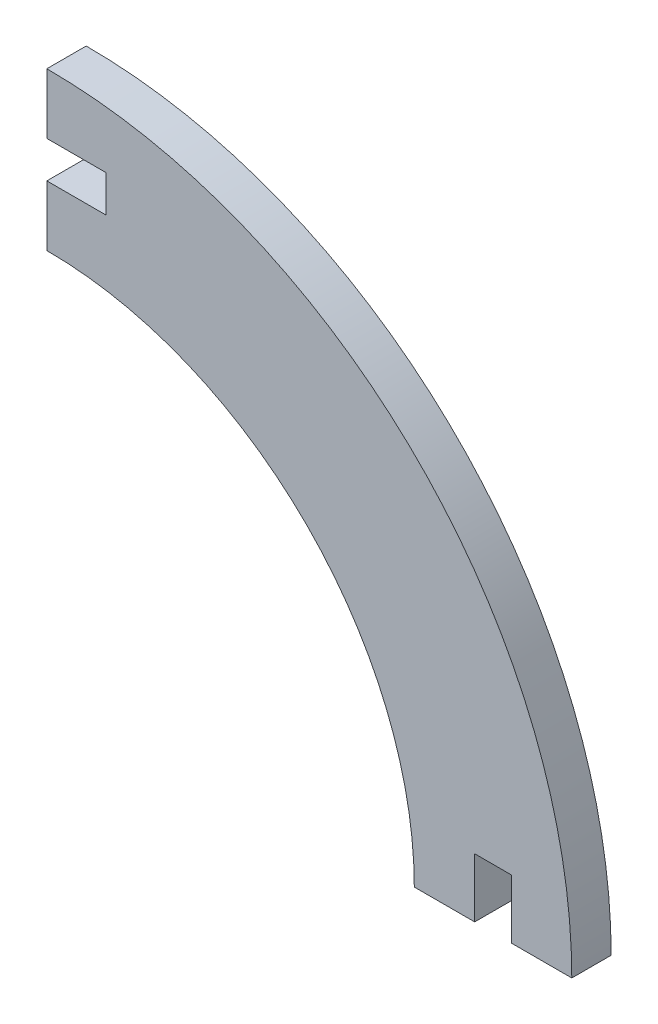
ISO-10303-21;
HEADER;
FILE_DESCRIPTION(('STEP AP214'),'2;1');
FILE_NAME('part.step','',(''),(''),'','','');
FILE_SCHEMA(('AUTOMOTIVE_DESIGN { 1 0 10303 214 1 1 1 1 }'));
ENDSEC;
DATA;
#1=APPLICATION_CONTEXT('core data for automotive mechanical design processes');
#2=APPLICATION_PROTOCOL_DEFINITION('international standard','automotive_design',2000,#1);
#3=PRODUCT_CONTEXT('',#1,'mechanical');
#4=PRODUCT('Part','Part','',(#3));
#5=PRODUCT_RELATED_PRODUCT_CATEGORY('part','',(#4));
#6=PRODUCT_DEFINITION_FORMATION('','',#4);
#7=PRODUCT_DEFINITION_CONTEXT('part definition',#1,'design');
#8=PRODUCT_DEFINITION('design','',#6,#7);
#9=PRODUCT_DEFINITION_SHAPE('','',#8);
#10=(LENGTH_UNIT() NAMED_UNIT(*) SI_UNIT(.MILLI.,.METRE.));
#11=(NAMED_UNIT(*) PLANE_ANGLE_UNIT() SI_UNIT($,.RADIAN.));
#12=(NAMED_UNIT(*) SI_UNIT($,.STERADIAN.) SOLID_ANGLE_UNIT());
#13=UNCERTAINTY_MEASURE_WITH_UNIT(LENGTH_MEASURE(1.E-05),#10,'distance_accuracy_value','');
#14=(GEOMETRIC_REPRESENTATION_CONTEXT(3) GLOBAL_UNCERTAINTY_ASSIGNED_CONTEXT((#13)) GLOBAL_UNIT_ASSIGNED_CONTEXT((#10,
#11,#12)) REPRESENTATION_CONTEXT('',''));
#15=CARTESIAN_POINT('',(0.,0.,0.));
#16=DIRECTION('',(0.,0.,1.));
#17=DIRECTION('',(1.,0.,0.));
#18=AXIS2_PLACEMENT_3D('',#15,#16,#17);
#19=CARTESIAN_POINT('',(0.,-3.32449345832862E-10,3.));
#20=DIRECTION('',(0.,0.,-1.));
#21=DIRECTION('',(-1.,0.,0.));
#22=AXIS2_PLACEMENT_3D('',#19,#20,#21);
#23=CYLINDRICAL_SURFACE('',#22,40.0000000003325);
#24=CARTESIAN_POINT('',(0.,-3.32449345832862E-10,0.));
#25=DIRECTION('',(0.,0.,1.));
#26=DIRECTION('',(-1.,0.,0.));
#27=AXIS2_PLACEMENT_3D('',#24,#25,#26);
#28=CIRCLE('',#27,40.0000000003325);
#29=CARTESIAN_POINT('',(40.0000000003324,-3.32446896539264E-10,0.));
#30=VERTEX_POINT('',#29);
#31=CARTESIAN_POINT('',(0.,40.,0.));
#32=VERTEX_POINT('',#31);
#33=EDGE_CURVE('E153',#30,#32,#28,.T.);
#34=ORIENTED_EDGE('',*,*,#33,.T.);
#35=DIRECTION('',(0.,0.,-1.));
#36=VECTOR('',#35,1.);
#37=CARTESIAN_POINT('',(0.,40.,3.));
#38=LINE('',#37,#36);
#39=CARTESIAN_POINT('',(0.,40.,3.));
#40=VERTEX_POINT('',#39);
#41=EDGE_CURVE('E11',#40,#32,#38,.T.);
#42=ORIENTED_EDGE('',*,*,#41,.F.);
#43=CARTESIAN_POINT('',(0.,-3.32449345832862E-10,3.));
#44=DIRECTION('',(0.,0.,1.));
#45=DIRECTION('',(-1.,0.,0.));
#46=AXIS2_PLACEMENT_3D('',#43,#44,#45);
#47=CIRCLE('',#46,40.0000000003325);
#48=CARTESIAN_POINT('',(40.0000000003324,-3.32446896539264E-10,3.));
#49=VERTEX_POINT('',#48);
#50=EDGE_CURVE('E175',#49,#40,#47,.T.);
#51=ORIENTED_EDGE('',*,*,#50,.F.);
#52=DIRECTION('',(0.,0.,-1.));
#53=VECTOR('',#52,1.);
#54=CARTESIAN_POINT('',(40.0000000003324,-3.32446896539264E-10,3.));
#55=LINE('',#54,#53);
#56=EDGE_CURVE('E149',#49,#30,#55,.T.);
#57=ORIENTED_EDGE('',*,*,#56,.T.);
#58=EDGE_LOOP('',(#34,#42,#51,#57));
#59=FACE_BOUND('',#58,.T.);
#60=ADVANCED_FACE('F33',(#59),#23,.T.);
#61=CARTESIAN_POINT('',(0.,35.4,3.));
#62=DIRECTION('',(1.,0.,0.));
#63=DIRECTION('',(0.,1.,0.));
#64=AXIS2_PLACEMENT_3D('',#61,#62,#63);
#65=PLANE('',#64);
#66=DIRECTION('',(0.,-1.,0.));
#67=VECTOR('',#66,1.);
#68=CARTESIAN_POINT('',(0.,35.4,0.));
#69=LINE('',#68,#67);
#70=CARTESIAN_POINT('',(0.,35.4,0.));
#71=VERTEX_POINT('',#70);
#72=EDGE_CURVE('E156',#32,#71,#69,.T.);
#73=ORIENTED_EDGE('',*,*,#72,.T.);
#74=DIRECTION('',(0.,0.,-1.));
#75=VECTOR('',#74,1.);
#76=CARTESIAN_POINT('',(0.,35.4,3.));
#77=LINE('',#76,#75);
#78=CARTESIAN_POINT('',(0.,35.4,3.));
#79=VERTEX_POINT('',#78);
#80=EDGE_CURVE('E41',#79,#71,#77,.T.);
#81=ORIENTED_EDGE('',*,*,#80,.F.);
#82=DIRECTION('',(0.,-1.,0.));
#83=VECTOR('',#82,1.);
#84=CARTESIAN_POINT('',(0.,35.4,3.));
#85=LINE('',#84,#83);
#86=EDGE_CURVE('E104',#40,#79,#85,.T.);
#87=ORIENTED_EDGE('',*,*,#86,.F.);
#88=ORIENTED_EDGE('',*,*,#41,.T.);
#89=EDGE_LOOP('',(#73,#81,#87,#88));
#90=FACE_BOUND('',#89,.T.);
#91=ADVANCED_FACE('F253',(#90),#65,.F.);
#92=CARTESIAN_POINT('',(0.,35.4,3.));
#93=DIRECTION('',(0.,1.,0.));
#94=DIRECTION('',(0.,0.,1.));
#95=AXIS2_PLACEMENT_3D('',#92,#93,#94);
#96=PLANE('',#95);
#97=DIRECTION('',(1.,0.,0.));
#98=VECTOR('',#97,1.);
#99=CARTESIAN_POINT('',(0.,35.4,0.));
#100=LINE('',#99,#98);
#101=CARTESIAN_POINT('',(4.5,35.4,0.));
#102=VERTEX_POINT('',#101);
#103=EDGE_CURVE('E158',#71,#102,#100,.T.);
#104=ORIENTED_EDGE('',*,*,#103,.T.);
#105=DIRECTION('',(0.,0.,-1.));
#106=VECTOR('',#105,1.);
#107=CARTESIAN_POINT('',(4.5,35.4,3.));
#108=LINE('',#107,#106);
#109=CARTESIAN_POINT('',(4.5,35.4,3.));
#110=VERTEX_POINT('',#109);
#111=EDGE_CURVE('E194',#110,#102,#108,.T.);
#112=ORIENTED_EDGE('',*,*,#111,.F.);
#113=DIRECTION('',(1.,0.,0.));
#114=VECTOR('',#113,1.);
#115=CARTESIAN_POINT('',(0.,35.4,3.));
#116=LINE('',#115,#114);
#117=EDGE_CURVE('E202',#79,#110,#116,.T.);
#118=ORIENTED_EDGE('',*,*,#117,.F.);
#119=ORIENTED_EDGE('',*,*,#80,.T.);
#120=EDGE_LOOP('',(#104,#112,#118,#119));
#121=FACE_BOUND('',#120,.T.);
#122=ADVANCED_FACE('F200',(#121),#96,.F.);
#123=CARTESIAN_POINT('',(4.5,35.4,3.));
#124=DIRECTION('',(1.,0.,0.));
#125=DIRECTION('',(0.,0.,-1.));
#126=AXIS2_PLACEMENT_3D('',#123,#124,#125);
#127=PLANE('',#126);
#128=DIRECTION('',(0.,-1.,0.));
#129=VECTOR('',#128,1.);
#130=CARTESIAN_POINT('',(4.5,35.4,0.));
#131=LINE('',#130,#129);
#132=CARTESIAN_POINT('',(4.5,32.6,0.));
#133=VERTEX_POINT('',#132);
#134=EDGE_CURVE('E160',#102,#133,#131,.T.);
#135=ORIENTED_EDGE('',*,*,#134,.T.);
#136=DIRECTION('',(0.,0.,-1.));
#137=VECTOR('',#136,1.);
#138=CARTESIAN_POINT('',(4.5,32.6,3.));
#139=LINE('',#138,#137);
#140=CARTESIAN_POINT('',(4.5,32.6,3.));
#141=VERTEX_POINT('',#140);
#142=EDGE_CURVE('E191',#141,#133,#139,.T.);
#143=ORIENTED_EDGE('',*,*,#142,.F.);
#144=DIRECTION('',(0.,-1.,0.));
#145=VECTOR('',#144,1.);
#146=CARTESIAN_POINT('',(4.5,35.4,3.));
#147=LINE('',#146,#145);
#148=EDGE_CURVE('E220',#110,#141,#147,.T.);
#149=ORIENTED_EDGE('',*,*,#148,.F.);
#150=ORIENTED_EDGE('',*,*,#111,.T.);
#151=EDGE_LOOP('',(#135,#143,#149,#150));
#152=FACE_BOUND('',#151,.T.);
#153=ADVANCED_FACE('F211',(#152),#127,.F.);
#154=CARTESIAN_POINT('',(0.,32.6,3.));
#155=DIRECTION('',(0.,-1.,0.));
#156=DIRECTION('',(1.,0.,0.));
#157=AXIS2_PLACEMENT_3D('',#154,#155,#156);
#158=PLANE('',#157);
#159=DIRECTION('',(-1.,0.,0.));
#160=VECTOR('',#159,1.);
#161=CARTESIAN_POINT('',(0.,32.6,0.));
#162=LINE('',#161,#160);
#163=CARTESIAN_POINT('',(0.,32.6,0.));
#164=VERTEX_POINT('',#163);
#165=EDGE_CURVE('E162',#133,#164,#162,.T.);
#166=ORIENTED_EDGE('',*,*,#165,.T.);
#167=DIRECTION('',(0.,0.,-1.));
#168=VECTOR('',#167,1.);
#169=CARTESIAN_POINT('',(0.,32.6,3.));
#170=LINE('',#169,#168);
#171=CARTESIAN_POINT('',(0.,32.6,3.));
#172=VERTEX_POINT('',#171);
#173=EDGE_CURVE('E188',#172,#164,#170,.T.);
#174=ORIENTED_EDGE('',*,*,#173,.F.);
#175=DIRECTION('',(-1.,0.,0.));
#176=VECTOR('',#175,1.);
#177=CARTESIAN_POINT('',(0.,32.6,3.));
#178=LINE('',#177,#176);
#179=EDGE_CURVE('E217',#141,#172,#178,.T.);
#180=ORIENTED_EDGE('',*,*,#179,.F.);
#181=ORIENTED_EDGE('',*,*,#142,.T.);
#182=EDGE_LOOP('',(#166,#174,#180,#181));
#183=FACE_BOUND('',#182,.T.);
#184=ADVANCED_FACE('F215',(#183),#158,.F.);
#185=CARTESIAN_POINT('',(0.,28.,3.));
#186=DIRECTION('',(1.,0.,0.));
#187=DIRECTION('',(0.,1.,0.));
#188=AXIS2_PLACEMENT_3D('',#185,#186,#187);
#189=PLANE('',#188);
#190=DIRECTION('',(0.,-1.,0.));
#191=VECTOR('',#190,1.);
#192=CARTESIAN_POINT('',(0.,28.,0.));
#193=LINE('',#192,#191);
#194=CARTESIAN_POINT('',(0.,28.,0.));
#195=VERTEX_POINT('',#194);
#196=EDGE_CURVE('E164',#164,#195,#193,.T.);
#197=ORIENTED_EDGE('',*,*,#196,.T.);
#198=DIRECTION('',(0.,0.,-1.));
#199=VECTOR('',#198,1.);
#200=CARTESIAN_POINT('',(0.,28.,3.));
#201=LINE('',#200,#199);
#202=CARTESIAN_POINT('',(0.,28.,3.));
#203=VERTEX_POINT('',#202);
#204=EDGE_CURVE('E185',#203,#195,#201,.T.);
#205=ORIENTED_EDGE('',*,*,#204,.F.);
#206=DIRECTION('',(0.,-1.,0.));
#207=VECTOR('',#206,1.);
#208=CARTESIAN_POINT('',(0.,28.,3.));
#209=LINE('',#208,#207);
#210=EDGE_CURVE('E219',#172,#203,#209,.T.);
#211=ORIENTED_EDGE('',*,*,#210,.F.);
#212=ORIENTED_EDGE('',*,*,#173,.T.);
#213=EDGE_LOOP('',(#197,#205,#211,#212));
#214=FACE_BOUND('',#213,.T.);
#215=ADVANCED_FACE('F266',(#214),#189,.F.);
#216=CARTESIAN_POINT('',(0.,-3.32449345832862E-10,3.));
#217=DIRECTION('',(0.,0.,-1.));
#218=DIRECTION('',(-1.,0.,0.));
#219=AXIS2_PLACEMENT_3D('',#216,#217,#218);
#220=CYLINDRICAL_SURFACE('',#219,28.0000000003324);
#221=CARTESIAN_POINT('',(0.,-3.32449345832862E-10,0.));
#222=DIRECTION('',(0.,0.,-1.));
#223=DIRECTION('',(-1.,0.,0.));
#224=AXIS2_PLACEMENT_3D('',#221,#222,#223);
#225=CIRCLE('',#224,28.0000000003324);
#226=CARTESIAN_POINT('',(28.0000000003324,-3.32447631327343E-10,0.));
#227=VERTEX_POINT('',#226);
#228=EDGE_CURVE('E166',#195,#227,#225,.T.);
#229=ORIENTED_EDGE('',*,*,#228,.T.);
#230=DIRECTION('',(0.,0.,-1.));
#231=VECTOR('',#230,1.);
#232=CARTESIAN_POINT('',(28.0000000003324,-3.32447631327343E-10,3.));
#233=LINE('',#232,#231);
#234=CARTESIAN_POINT('',(28.0000000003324,-3.32447631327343E-10,3.));
#235=VERTEX_POINT('',#234);
#236=EDGE_CURVE('E182',#235,#227,#233,.T.);
#237=ORIENTED_EDGE('',*,*,#236,.F.);
#238=CARTESIAN_POINT('',(0.,-3.32449345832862E-10,3.));
#239=DIRECTION('',(0.,0.,-1.));
#240=DIRECTION('',(-1.,0.,0.));
#241=AXIS2_PLACEMENT_3D('',#238,#239,#240);
#242=CIRCLE('',#241,28.0000000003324);
#243=EDGE_CURVE('E222',#203,#235,#242,.T.);
#244=ORIENTED_EDGE('',*,*,#243,.F.);
#245=ORIENTED_EDGE('',*,*,#204,.T.);
#246=EDGE_LOOP('',(#229,#237,#244,#245));
#247=FACE_BOUND('',#246,.T.);
#248=ADVANCED_FACE('F269',(#247),#220,.F.);
#249=CARTESIAN_POINT('',(28.0000000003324,-3.32447631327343E-10,3.));
#250=DIRECTION('',(0.,1.,0.));
#251=DIRECTION('',(-1.,0.,0.));
#252=AXIS2_PLACEMENT_3D('',#249,#250,#251);
#253=PLANE('',#252);
#254=DIRECTION('',(1.,0.,0.));
#255=VECTOR('',#254,1.);
#256=CARTESIAN_POINT('',(28.0000000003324,-3.32447631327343E-10,0.));
#257=LINE('',#256,#255);
#258=CARTESIAN_POINT('',(32.6000000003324,-3.32448540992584E-10,0.));
#259=VERTEX_POINT('',#258);
#260=EDGE_CURVE('E168',#227,#259,#257,.T.);
#261=ORIENTED_EDGE('',*,*,#260,.T.);
#262=DIRECTION('',(0.,0.,-1.));
#263=VECTOR('',#262,1.);
#264=CARTESIAN_POINT('',(32.6000000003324,-3.32448540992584E-10,3.));
#265=LINE('',#264,#263);
#266=CARTESIAN_POINT('',(32.6000000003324,-3.32448540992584E-10,3.));
#267=VERTEX_POINT('',#266);
#268=EDGE_CURVE('E179',#267,#259,#265,.T.);
#269=ORIENTED_EDGE('',*,*,#268,.F.);
#270=DIRECTION('',(1.,0.,0.));
#271=VECTOR('',#270,1.);
#272=CARTESIAN_POINT('',(28.0000000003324,-3.32447631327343E-10,3.));
#273=LINE('',#272,#271);
#274=EDGE_CURVE('E228',#235,#267,#273,.T.);
#275=ORIENTED_EDGE('',*,*,#274,.F.);
#276=ORIENTED_EDGE('',*,*,#236,.T.);
#277=EDGE_LOOP('',(#261,#269,#275,#276));
#278=FACE_BOUND('',#277,.T.);
#279=ADVANCED_FACE('F234',(#278),#253,.F.);
#280=CARTESIAN_POINT('',(32.6000000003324,4.49999999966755,3.));
#281=DIRECTION('',(-1.,0.,0.));
#282=DIRECTION('',(0.,-1.,0.));
#283=AXIS2_PLACEMENT_3D('',#280,#281,#282);
#284=PLANE('',#283);
#285=DIRECTION('',(0.,1.,0.));
#286=VECTOR('',#285,1.);
#287=CARTESIAN_POINT('',(32.6000000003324,4.49999999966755,0.));
#288=LINE('',#287,#286);
#289=CARTESIAN_POINT('',(32.6000000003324,4.49999999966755,0.));
#290=VERTEX_POINT('',#289);
#291=EDGE_CURVE('E170',#259,#290,#288,.T.);
#292=ORIENTED_EDGE('',*,*,#291,.T.);
#293=DIRECTION('',(0.,0.,-1.));
#294=VECTOR('',#293,1.);
#295=CARTESIAN_POINT('',(32.6000000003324,4.49999999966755,3.));
#296=LINE('',#295,#294);
#297=CARTESIAN_POINT('',(32.6000000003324,4.49999999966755,3.));
#298=VERTEX_POINT('',#297);
#299=EDGE_CURVE('E144',#298,#290,#296,.T.);
#300=ORIENTED_EDGE('',*,*,#299,.F.);
#301=DIRECTION('',(0.,1.,0.));
#302=VECTOR('',#301,1.);
#303=CARTESIAN_POINT('',(32.6000000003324,4.49999999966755,3.));
#304=LINE('',#303,#302);
#305=EDGE_CURVE('E135',#267,#298,#304,.T.);
#306=ORIENTED_EDGE('',*,*,#305,.F.);
#307=ORIENTED_EDGE('',*,*,#268,.T.);
#308=EDGE_LOOP('',(#292,#300,#306,#307));
#309=FACE_BOUND('',#308,.T.);
#310=ADVANCED_FACE('F238',(#309),#284,.F.);
#311=CARTESIAN_POINT('',(35.4000000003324,4.49999999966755,3.));
#312=DIRECTION('',(0.,1.,0.));
#313=DIRECTION('',(0.,0.,1.));
#314=AXIS2_PLACEMENT_3D('',#311,#312,#313);
#315=PLANE('',#314);
#316=DIRECTION('',(1.,0.,0.));
#317=VECTOR('',#316,1.);
#318=CARTESIAN_POINT('',(35.4000000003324,4.49999999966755,0.));
#319=LINE('',#318,#317);
#320=CARTESIAN_POINT('',(35.4000000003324,4.49999999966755,0.));
#321=VERTEX_POINT('',#320);
#322=EDGE_CURVE('E143',#290,#321,#319,.T.);
#323=ORIENTED_EDGE('',*,*,#322,.T.);
#324=DIRECTION('',(0.,0.,-1.));
#325=VECTOR('',#324,1.);
#326=CARTESIAN_POINT('',(35.4000000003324,4.49999999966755,3.));
#327=LINE('',#326,#325);
#328=CARTESIAN_POINT('',(35.4000000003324,4.49999999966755,3.));
#329=VERTEX_POINT('',#328);
#330=EDGE_CURVE('E140',#329,#321,#327,.T.);
#331=ORIENTED_EDGE('',*,*,#330,.F.);
#332=DIRECTION('',(1.,0.,0.));
#333=VECTOR('',#332,1.);
#334=CARTESIAN_POINT('',(35.4000000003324,4.49999999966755,3.));
#335=LINE('',#334,#333);
#336=EDGE_CURVE('E129',#298,#329,#335,.T.);
#337=ORIENTED_EDGE('',*,*,#336,.F.);
#338=ORIENTED_EDGE('',*,*,#299,.T.);
#339=EDGE_LOOP('',(#323,#331,#337,#338));
#340=FACE_BOUND('',#339,.T.);
#341=ADVANCED_FACE('F141',(#340),#315,.F.);
#342=CARTESIAN_POINT('',(35.4000000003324,4.49999999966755,3.));
#343=DIRECTION('',(1.,0.,0.));
#344=DIRECTION('',(0.,1.,0.));
#345=AXIS2_PLACEMENT_3D('',#342,#343,#344);
#346=PLANE('',#345);
#347=DIRECTION('',(0.,-1.,0.));
#348=VECTOR('',#347,1.);
#349=CARTESIAN_POINT('',(35.4000000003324,4.49999999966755,0.));
#350=LINE('',#349,#348);
#351=CARTESIAN_POINT('',(35.4000000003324,-3.32448390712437E-10,0.));
#352=VERTEX_POINT('',#351);
#353=EDGE_CURVE('E90',#321,#352,#350,.T.);
#354=ORIENTED_EDGE('',*,*,#353,.T.);
#355=DIRECTION('',(0.,0.,-1.));
#356=VECTOR('',#355,1.);
#357=CARTESIAN_POINT('',(35.4000000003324,-3.32448390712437E-10,3.));
#358=LINE('',#357,#356);
#359=CARTESIAN_POINT('',(35.4000000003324,-3.32448390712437E-10,3.));
#360=VERTEX_POINT('',#359);
#361=EDGE_CURVE('E145',#360,#352,#358,.T.);
#362=ORIENTED_EDGE('',*,*,#361,.F.);
#363=DIRECTION('',(0.,-1.,0.));
#364=VECTOR('',#363,1.);
#365=CARTESIAN_POINT('',(35.4000000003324,4.49999999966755,3.));
#366=LINE('',#365,#364);
#367=EDGE_CURVE('E133',#329,#360,#366,.T.);
#368=ORIENTED_EDGE('',*,*,#367,.F.);
#369=ORIENTED_EDGE('',*,*,#330,.T.);
#370=EDGE_LOOP('',(#354,#362,#368,#369));
#371=FACE_BOUND('',#370,.T.);
#372=ADVANCED_FACE('F147',(#371),#346,.F.);
#373=CARTESIAN_POINT('',(35.4000000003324,-3.32448390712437E-10,3.));
#374=DIRECTION('',(0.,1.,0.));
#375=DIRECTION('',(-1.,0.,0.));
#376=AXIS2_PLACEMENT_3D('',#373,#374,#375);
#377=PLANE('',#376);
#378=DIRECTION('',(1.,0.,0.));
#379=VECTOR('',#378,1.);
#380=CARTESIAN_POINT('',(35.4000000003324,-3.32448390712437E-10,0.));
#381=LINE('',#380,#379);
#382=EDGE_CURVE('E96',#352,#30,#381,.T.);
#383=ORIENTED_EDGE('',*,*,#382,.T.);
#384=ORIENTED_EDGE('',*,*,#56,.F.);
#385=DIRECTION('',(1.,0.,0.));
#386=VECTOR('',#385,1.);
#387=CARTESIAN_POINT('',(35.4000000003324,-3.32448390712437E-10,3.));
#388=LINE('',#387,#386);
#389=EDGE_CURVE('E49',#360,#49,#388,.T.);
#390=ORIENTED_EDGE('',*,*,#389,.F.);
#391=ORIENTED_EDGE('',*,*,#361,.T.);
#392=EDGE_LOOP('',(#383,#384,#390,#391));
#393=FACE_BOUND('',#392,.T.);
#394=ADVANCED_FACE('F242',(#393),#377,.F.);
#395=CARTESIAN_POINT('',(0.,-3.32449345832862E-10,3.));
#396=DIRECTION('',(0.,0.,-1.));
#397=DIRECTION('',(-1.,0.,0.));
#398=AXIS2_PLACEMENT_3D('',#395,#396,#397);
#399=PLANE('',#398);
#400=ORIENTED_EDGE('',*,*,#50,.T.);
#401=ORIENTED_EDGE('',*,*,#86,.T.);
#402=ORIENTED_EDGE('',*,*,#117,.T.);
#403=ORIENTED_EDGE('',*,*,#148,.T.);
#404=ORIENTED_EDGE('',*,*,#179,.T.);
#405=ORIENTED_EDGE('',*,*,#210,.T.);
#406=ORIENTED_EDGE('',*,*,#243,.T.);
#407=ORIENTED_EDGE('',*,*,#274,.T.);
#408=ORIENTED_EDGE('',*,*,#305,.T.);
#409=ORIENTED_EDGE('',*,*,#336,.T.);
#410=ORIENTED_EDGE('',*,*,#367,.T.);
#411=ORIENTED_EDGE('',*,*,#389,.T.);
#412=EDGE_LOOP('',(#400,#401,#402,#403,#404,#405,#406,#407,#408,#409,#410,#411));
#413=FACE_BOUND('',#412,.T.);
#414=ADVANCED_FACE('F131',(#413),#399,.F.);
#415=CARTESIAN_POINT('',(0.,-3.32449345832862E-10,0.));
#416=DIRECTION('',(0.,0.,-1.));
#417=DIRECTION('',(-1.,0.,0.));
#418=AXIS2_PLACEMENT_3D('',#415,#416,#417);
#419=PLANE('',#418);
#420=ORIENTED_EDGE('',*,*,#33,.F.);
#421=ORIENTED_EDGE('',*,*,#382,.F.);
#422=ORIENTED_EDGE('',*,*,#353,.F.);
#423=ORIENTED_EDGE('',*,*,#322,.F.);
#424=ORIENTED_EDGE('',*,*,#291,.F.);
#425=ORIENTED_EDGE('',*,*,#260,.F.);
#426=ORIENTED_EDGE('',*,*,#228,.F.);
#427=ORIENTED_EDGE('',*,*,#196,.F.);
#428=ORIENTED_EDGE('',*,*,#165,.F.);
#429=ORIENTED_EDGE('',*,*,#134,.F.);
#430=ORIENTED_EDGE('',*,*,#103,.F.);
#431=ORIENTED_EDGE('',*,*,#72,.F.);
#432=EDGE_LOOP('',(#420,#421,#422,#423,#424,#425,#426,#427,#428,#429,#430,#431));
#433=FACE_BOUND('',#432,.T.);
#434=ADVANCED_FACE('F206',(#433),#419,.T.);
#435=CLOSED_SHELL('',(#60,#91,#122,#153,#184,#215,#248,#279,#310,#341,#372,#394,#414,#434));
#436=MANIFOLD_SOLID_BREP('B2',#435);
#437=ADVANCED_BREP_SHAPE_REPRESENTATION('',(#18,#436),#14);
#438=SHAPE_DEFINITION_REPRESENTATION(#9,#437);
ENDSEC;
END-ISO-10303-21;
